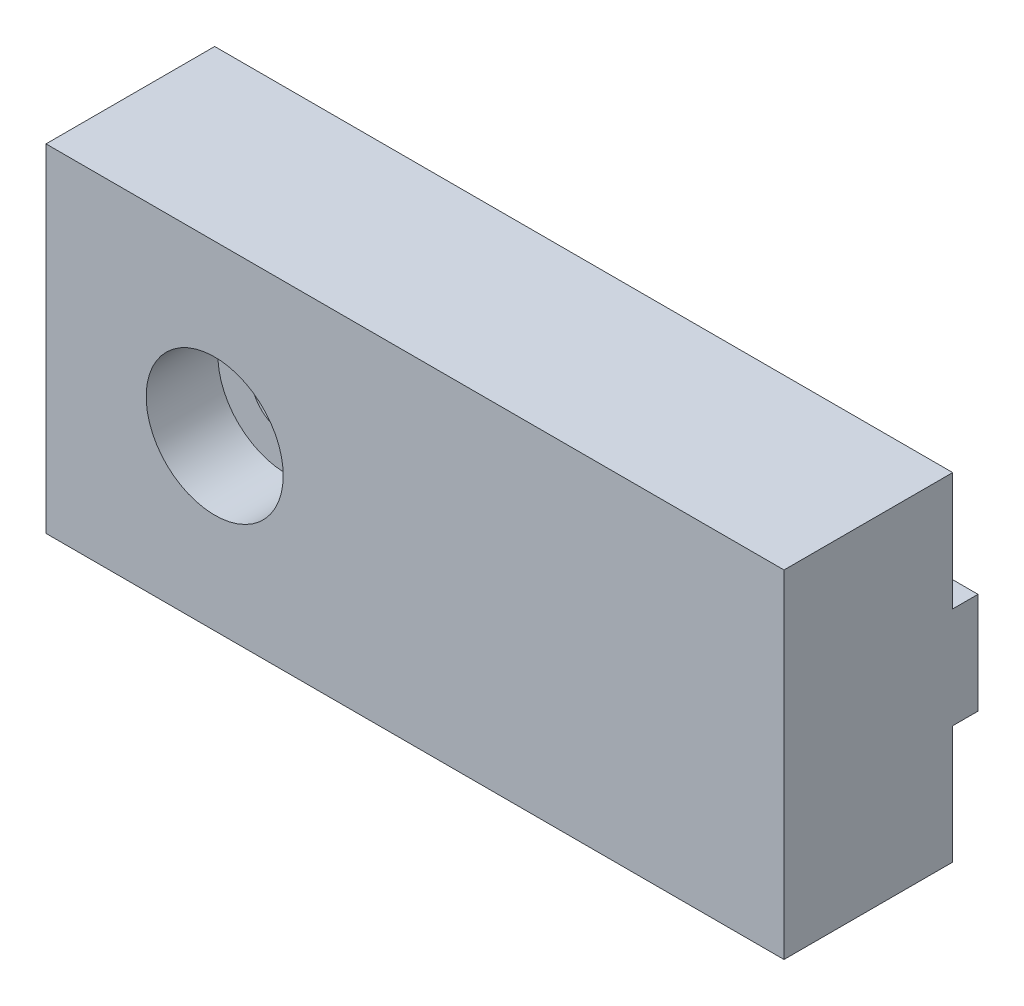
from build123d import *

# Parameters (mm, degrees)
SKIZZE1_W                                            = 35
SKIZZE1_H                                            = 16
AUFSATZ_LINEAR_AUSTRAGEN1_DEPTH                      = 8
SKIZZE2_W                                            = 35
SKIZZE2_H                                            = 4.8
AUFSATZ_LINEAR_AUSTRAGEN2_DEPTH                      = 1.2
STIRNSENKUNG_F_R_M3_ZYLINDERSCHRAUBE_MIT_D           = 3.4
STIRNSENKUNG_F_R_M3_ZYLINDERSCHRAUBE_MIT_CBORE_D     = 6.5
STIRNSENKUNG_F_R_M3_ZYLINDERSCHRAUBE_MIT_CBORE_DEPTH = 3.4


with BuildPart() as part:
    # Skizze1 → Aufsatz-Linear austragen1 (new body)
    with BuildSketch(Plane.XY):
        Rectangle(SKIZZE1_W, SKIZZE1_H)
    extrude(amount=AUFSATZ_LINEAR_AUSTRAGEN1_DEPTH)

    # Skizze2 → Aufsatz-Linear austragen2 (add)
    with BuildSketch(Plane(origin=(0, 0, 0), x_dir=(-1, 0, 0), z_dir=(0, 0, -1))):
        Rectangle(SKIZZE2_W, SKIZZE2_H)
    extrude(amount=AUFSATZ_LINEAR_AUSTRAGEN2_DEPTH)

    # Stirnsenkung f_r M3 Zylinderschraube mit (through all)
    with Locations(Plane.XY.offset(8)):
        with Locations((-9.5, 0)):
            CounterBoreHole(STIRNSENKUNG_F_R_M3_ZYLINDERSCHRAUBE_MIT_D / 2, STIRNSENKUNG_F_R_M3_ZYLINDERSCHRAUBE_MIT_CBORE_D / 2, STIRNSENKUNG_F_R_M3_ZYLINDERSCHRAUBE_MIT_CBORE_DEPTH)


solid = part.part
